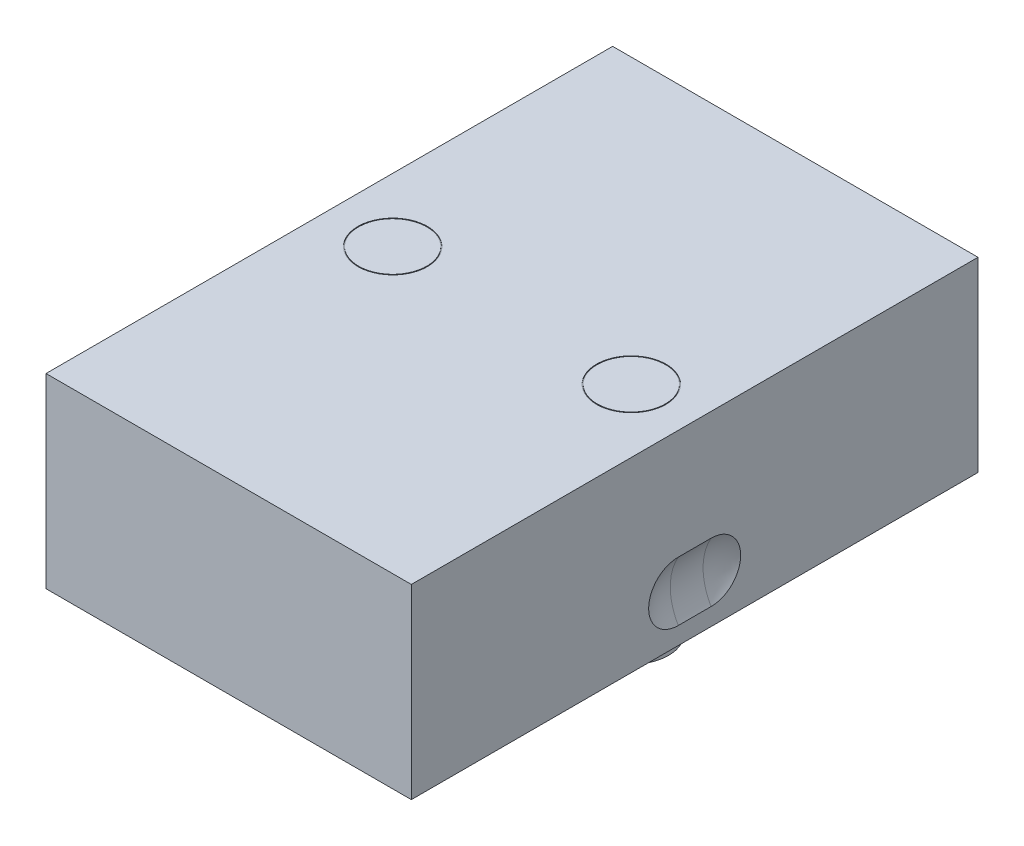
ISO-10303-21;
HEADER;
FILE_DESCRIPTION(('STEP AP214'),'2;1');
FILE_NAME('part.step','',(''),(''),'','','');
FILE_SCHEMA(('AUTOMOTIVE_DESIGN { 1 0 10303 214 1 1 1 1 }'));
ENDSEC;
DATA;
#1=APPLICATION_CONTEXT('core data for automotive mechanical design processes');
#2=APPLICATION_PROTOCOL_DEFINITION('international standard','automotive_design',2000,#1);
#3=PRODUCT_CONTEXT('',#1,'mechanical');
#4=PRODUCT('Part','Part','',(#3));
#5=PRODUCT_RELATED_PRODUCT_CATEGORY('part','',(#4));
#6=PRODUCT_DEFINITION_FORMATION('','',#4);
#7=PRODUCT_DEFINITION_CONTEXT('part definition',#1,'design');
#8=PRODUCT_DEFINITION('design','',#6,#7);
#9=PRODUCT_DEFINITION_SHAPE('','',#8);
#10=(LENGTH_UNIT() NAMED_UNIT(*) SI_UNIT(.MILLI.,.METRE.));
#11=(NAMED_UNIT(*) PLANE_ANGLE_UNIT() SI_UNIT($,.RADIAN.));
#12=(NAMED_UNIT(*) SI_UNIT($,.STERADIAN.) SOLID_ANGLE_UNIT());
#13=UNCERTAINTY_MEASURE_WITH_UNIT(LENGTH_MEASURE(1.E-05),#10,'distance_accuracy_value','');
#14=(GEOMETRIC_REPRESENTATION_CONTEXT(3) GLOBAL_UNCERTAINTY_ASSIGNED_CONTEXT((#13)) GLOBAL_UNIT_ASSIGNED_CONTEXT((#10,
#11,#12)) REPRESENTATION_CONTEXT('',''));
#15=CARTESIAN_POINT('',(0.,0.,0.));
#16=DIRECTION('',(0.,0.,1.));
#17=DIRECTION('',(1.,0.,0.));
#18=AXIS2_PLACEMENT_3D('',#15,#16,#17);
#19=CARTESIAN_POINT('',(-16.,72.,0.));
#20=DIRECTION('',(0.,1.,0.));
#21=DIRECTION('',(0.,0.,1.));
#22=AXIS2_PLACEMENT_3D('',#19,#20,#21);
#23=PLANE('',#22);
#24=CARTESIAN_POINT('',(-16.,72.,0.));
#25=DIRECTION('',(0.,-1.,0.));
#26=DIRECTION('',(0.,0.,-1.));
#27=AXIS2_PLACEMENT_3D('',#24,#25,#26);
#28=CIRCLE('',#27,4.57);
#29=CARTESIAN_POINT('',(-16.,72.,-4.57));
#30=VERTEX_POINT('',#29);
#31=EDGE_CURVE('E9',#30,#30,#28,.F.);
#32=ORIENTED_EDGE('',*,*,#31,.F.);
#33=EDGE_LOOP('',(#32));
#34=FACE_BOUND('',#33,.T.);
#35=ADVANCED_FACE('F14',(#34),#23,.F.);
#36=CARTESIAN_POINT('',(-16.,75.,0.));
#37=DIRECTION('',(0.,1.,0.));
#38=DIRECTION('',(0.,0.,1.));
#39=AXIS2_PLACEMENT_3D('',#36,#37,#38);
#40=PLANE('',#39);
#41=CARTESIAN_POINT('',(-16.,75.,0.));
#42=DIRECTION('',(0.,1.,0.));
#43=DIRECTION('',(0.,0.,1.));
#44=AXIS2_PLACEMENT_3D('',#41,#42,#43);
#45=CIRCLE('',#44,4.67);
#46=CARTESIAN_POINT('',(-16.,75.,4.67));
#47=VERTEX_POINT('',#46);
#48=EDGE_CURVE('E255',#47,#47,#45,.T.);
#49=ORIENTED_EDGE('',*,*,#48,.F.);
#50=EDGE_LOOP('',(#49));
#51=FACE_BOUND('',#50,.T.);
#52=CARTESIAN_POINT('',(16.,75.,0.));
#53=DIRECTION('',(0.,1.,0.));
#54=DIRECTION('',(0.,0.,1.));
#55=AXIS2_PLACEMENT_3D('',#52,#53,#54);
#56=CIRCLE('',#55,4.67);
#57=CARTESIAN_POINT('',(16.,75.,4.67));
#58=VERTEX_POINT('',#57);
#59=EDGE_CURVE('E238',#58,#58,#56,.T.);
#60=ORIENTED_EDGE('',*,*,#59,.F.);
#61=EDGE_LOOP('',(#60));
#62=FACE_BOUND('',#61,.T.);
#63=DIRECTION('',(0.,0.,1.));
#64=VECTOR('',#63,1.);
#65=CARTESIAN_POINT('',(-24.5,75.,0.));
#66=LINE('',#65,#64);
#67=CARTESIAN_POINT('',(-24.5,75.,-38.));
#68=VERTEX_POINT('',#67);
#69=CARTESIAN_POINT('',(-24.5,75.,38.));
#70=VERTEX_POINT('',#69);
#71=EDGE_CURVE('E222',#68,#70,#66,.T.);
#72=ORIENTED_EDGE('',*,*,#71,.T.);
#73=DIRECTION('',(1.,0.,0.));
#74=VECTOR('',#73,1.);
#75=CARTESIAN_POINT('',(0.,75.,38.));
#76=LINE('',#75,#74);
#77=CARTESIAN_POINT('',(24.5,75.,38.));
#78=VERTEX_POINT('',#77);
#79=EDGE_CURVE('E220',#70,#78,#76,.T.);
#80=ORIENTED_EDGE('',*,*,#79,.T.);
#81=DIRECTION('',(0.,0.,1.));
#82=VECTOR('',#81,1.);
#83=CARTESIAN_POINT('',(24.5,75.,0.));
#84=LINE('',#83,#82);
#85=CARTESIAN_POINT('',(24.5,75.,-38.));
#86=VERTEX_POINT('',#85);
#87=EDGE_CURVE('E214',#78,#86,#84,.F.);
#88=ORIENTED_EDGE('',*,*,#87,.T.);
#89=DIRECTION('',(1.,0.,0.));
#90=VECTOR('',#89,1.);
#91=CARTESIAN_POINT('',(0.,75.,-38.));
#92=LINE('',#91,#90);
#93=EDGE_CURVE('E225',#86,#68,#92,.F.);
#94=ORIENTED_EDGE('',*,*,#93,.T.);
#95=EDGE_LOOP('',(#72,#80,#88,#94));
#96=FACE_BOUND('',#95,.T.);
#97=ADVANCED_FACE('F182',(#51,#62,#96),#40,.T.);
#98=CARTESIAN_POINT('',(16.,72.,0.));
#99=DIRECTION('',(0.,1.,0.));
#100=DIRECTION('',(0.,0.,1.));
#101=AXIS2_PLACEMENT_3D('',#98,#99,#100);
#102=PLANE('',#101);
#103=CARTESIAN_POINT('',(16.,72.,0.));
#104=DIRECTION('',(0.,-1.,0.));
#105=DIRECTION('',(0.,0.,-1.));
#106=AXIS2_PLACEMENT_3D('',#103,#104,#105);
#107=CIRCLE('',#106,4.57);
#108=CARTESIAN_POINT('',(16.,72.,-4.57));
#109=VERTEX_POINT('',#108);
#110=EDGE_CURVE('E23',#109,#109,#107,.F.);
#111=ORIENTED_EDGE('',*,*,#110,.F.);
#112=EDGE_LOOP('',(#111));
#113=FACE_BOUND('',#112,.T.);
#114=ADVANCED_FACE('F179',(#113),#102,.F.);
#115=CARTESIAN_POINT('',(16.,62.5,0.));
#116=DIRECTION('',(0.,-1.,0.));
#117=DIRECTION('',(0.,0.,-1.));
#118=AXIS2_PLACEMENT_3D('',#115,#116,#117);
#119=CYLINDRICAL_SURFACE('',#118,4.57);
#120=CARTESIAN_POINT('',(16.,53.,0.));
#121=DIRECTION('',(0.,-1.,0.));
#122=DIRECTION('',(0.,0.,-1.));
#123=AXIS2_PLACEMENT_3D('',#120,#121,#122);
#124=CIRCLE('',#123,4.57);
#125=CARTESIAN_POINT('',(16.,53.,-4.57));
#126=VERTEX_POINT('',#125);
#127=EDGE_CURVE('E343',#126,#126,#124,.F.);
#128=ORIENTED_EDGE('',*,*,#127,.F.);
#129=EDGE_LOOP('',(#128));
#130=FACE_BOUND('',#129,.T.);
#131=ORIENTED_EDGE('',*,*,#110,.T.);
#132=EDGE_LOOP('',(#131));
#133=FACE_BOUND('',#132,.T.);
#134=ADVANCED_FACE('F181',(#130,#133),#119,.F.);
#135=CARTESIAN_POINT('',(19.785,53.,0.));
#136=DIRECTION('',(0.,-1.,0.));
#137=DIRECTION('',(0.,0.,-1.));
#138=AXIS2_PLACEMENT_3D('',#135,#136,#137);
#139=PLANE('',#138);
#140=ORIENTED_EDGE('',*,*,#127,.T.);
#141=EDGE_LOOP('',(#140));
#142=FACE_BOUND('',#141,.T.);
#143=CARTESIAN_POINT('',(16.,52.9999999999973,0.));
#144=DIRECTION('',(0.,1.,0.));
#145=DIRECTION('',(0.,0.,1.));
#146=AXIS2_PLACEMENT_3D('',#143,#144,#145);
#147=CIRCLE('',#146,3.00000000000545);
#148=CARTESIAN_POINT('',(16.,52.9999999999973,3.00000000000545));
#149=VERTEX_POINT('',#148);
#150=EDGE_CURVE('E357',#149,#149,#147,.T.);
#151=ORIENTED_EDGE('',*,*,#150,.F.);
#152=EDGE_LOOP('',(#151));
#153=FACE_BOUND('',#152,.T.);
#154=ADVANCED_FACE('F189',(#142,#153),#139,.F.);
#155=CARTESIAN_POINT('',(16.,52.9999999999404,0.));
#156=DIRECTION('',(0.,1.,0.));
#157=DIRECTION('',(0.,0.,1.));
#158=AXIS2_PLACEMENT_3D('',#155,#156,#157);
#159=CONICAL_SURFACE('',#158,2.99999999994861,0.785398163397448);
#160=CARTESIAN_POINT('',(16.,52.6,0.));
#161=DIRECTION('',(0.,-1.,0.));
#162=DIRECTION('',(0.,0.,-1.));
#163=AXIS2_PLACEMENT_3D('',#160,#161,#162);
#164=CIRCLE('',#163,2.6);
#165=CARTESIAN_POINT('',(16.,52.6,-2.6));
#166=VERTEX_POINT('',#165);
#167=EDGE_CURVE('E230',#166,#166,#164,.T.);
#168=ORIENTED_EDGE('',*,*,#167,.T.);
#169=EDGE_LOOP('',(#168));
#170=FACE_BOUND('',#169,.T.);
#171=ORIENTED_EDGE('',*,*,#150,.T.);
#172=EDGE_LOOP('',(#171));
#173=FACE_BOUND('',#172,.T.);
#174=ADVANCED_FACE('F299',(#170,#173),#159,.F.);
#175=CARTESIAN_POINT('',(16.,49.3,0.));
#176=DIRECTION('',(0.,-1.,0.));
#177=DIRECTION('',(0.,0.,-1.));
#178=AXIS2_PLACEMENT_3D('',#175,#176,#177);
#179=CYLINDRICAL_SURFACE('',#178,2.6);
#180=CARTESIAN_POINT('',(16.,46.,0.));
#181=DIRECTION('',(0.,-1.,0.));
#182=DIRECTION('',(0.,0.,-1.));
#183=AXIS2_PLACEMENT_3D('',#180,#181,#182);
#184=CIRCLE('',#183,2.6);
#185=CARTESIAN_POINT('',(16.,46.,-2.6));
#186=VERTEX_POINT('',#185);
#187=EDGE_CURVE('E352',#186,#186,#184,.F.);
#188=ORIENTED_EDGE('',*,*,#187,.F.);
#189=EDGE_LOOP('',(#188));
#190=FACE_BOUND('',#189,.T.);
#191=ORIENTED_EDGE('',*,*,#167,.F.);
#192=EDGE_LOOP('',(#191));
#193=FACE_BOUND('',#192,.T.);
#194=ADVANCED_FACE('F302',(#190,#193),#179,.F.);
#195=CARTESIAN_POINT('',(18.5,46.,0.));
#196=DIRECTION('',(0.,-1.,0.));
#197=DIRECTION('',(0.,0.,-1.));
#198=AXIS2_PLACEMENT_3D('',#195,#196,#197);
#199=PLANE('',#198);
#200=CARTESIAN_POINT('',(16.,46.,0.));
#201=DIRECTION('',(0.,-1.,0.));
#202=DIRECTION('',(0.,0.,-1.));
#203=AXIS2_PLACEMENT_3D('',#200,#201,#202);
#204=CIRCLE('',#203,5.);
#205=CARTESIAN_POINT('',(16.,46.,-5.));
#206=VERTEX_POINT('',#205);
#207=EDGE_CURVE('E79',#206,#206,#204,.F.);
#208=ORIENTED_EDGE('',*,*,#207,.F.);
#209=EDGE_LOOP('',(#208));
#210=FACE_BOUND('',#209,.T.);
#211=ORIENTED_EDGE('',*,*,#187,.T.);
#212=EDGE_LOOP('',(#211));
#213=FACE_BOUND('',#212,.T.);
#214=ADVANCED_FACE('F309',(#210,#213),#199,.T.);
#215=CARTESIAN_POINT('',(-16.,48.5,0.));
#216=DIRECTION('',(0.,-1.,0.));
#217=DIRECTION('',(0.,0.,-1.));
#218=AXIS2_PLACEMENT_3D('',#215,#216,#217);
#219=CYLINDRICAL_SURFACE('',#218,5.);
#220=CARTESIAN_POINT('',(-16.,50.,0.));
#221=DIRECTION('',(0.,-1.,0.));
#222=DIRECTION('',(0.,0.,-1.));
#223=AXIS2_PLACEMENT_3D('',#220,#221,#222);
#224=CIRCLE('',#223,5.);
#225=CARTESIAN_POINT('',(-16.,50.,-5.));
#226=VERTEX_POINT('',#225);
#227=EDGE_CURVE('E602',#226,#226,#224,.T.);
#228=ORIENTED_EDGE('',*,*,#227,.T.);
#229=EDGE_LOOP('',(#228));
#230=FACE_BOUND('',#229,.T.);
#231=CARTESIAN_POINT('',(-16.,46.,0.));
#232=DIRECTION('',(0.,-1.,0.));
#233=DIRECTION('',(0.,0.,-1.));
#234=AXIS2_PLACEMENT_3D('',#231,#232,#233);
#235=CIRCLE('',#234,5.);
#236=CARTESIAN_POINT('',(-16.,46.,-5.));
#237=VERTEX_POINT('',#236);
#238=EDGE_CURVE('E340',#237,#237,#235,.F.);
#239=ORIENTED_EDGE('',*,*,#238,.T.);
#240=EDGE_LOOP('',(#239));
#241=FACE_BOUND('',#240,.T.);
#242=ADVANCED_FACE('F193',(#230,#241),#219,.T.);
#243=CARTESIAN_POINT('',(16.,48.5,0.));
#244=DIRECTION('',(0.,-1.,0.));
#245=DIRECTION('',(0.,0.,-1.));
#246=AXIS2_PLACEMENT_3D('',#243,#244,#245);
#247=CYLINDRICAL_SURFACE('',#246,5.);
#248=CARTESIAN_POINT('',(16.,50.,0.));
#249=DIRECTION('',(0.,-1.,0.));
#250=DIRECTION('',(0.,0.,-1.));
#251=AXIS2_PLACEMENT_3D('',#248,#249,#250);
#252=CIRCLE('',#251,5.);
#253=CARTESIAN_POINT('',(16.,50.,-5.));
#254=VERTEX_POINT('',#253);
#255=EDGE_CURVE('E93',#254,#254,#252,.T.);
#256=ORIENTED_EDGE('',*,*,#255,.T.);
#257=EDGE_LOOP('',(#256));
#258=FACE_BOUND('',#257,.T.);
#259=ORIENTED_EDGE('',*,*,#207,.T.);
#260=EDGE_LOOP('',(#259));
#261=FACE_BOUND('',#260,.T.);
#262=ADVANCED_FACE('F327',(#258,#261),#247,.T.);
#263=CARTESIAN_POINT('',(31.3299999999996,56.3,2.20000000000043));
#264=DIRECTION('',(0.710359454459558,0.618323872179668,0.33625144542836));
#265=DIRECTION('',(0.703004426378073,-0.646571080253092,-0.296193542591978));
#266=AXIS2_PLACEMENT_3D('',#263,#264,#265);
#267=SPHERICAL_SURFACE('',#266,7.9);
#268=CARTESIAN_POINT('',(31.33,56.3,2.2));
#269=DIRECTION('',(0.,0.,-1.));
#270=DIRECTION('',(-1.,0.,0.));
#271=AXIS2_PLACEMENT_3D('',#268,#269,#270);
#272=CIRCLE('',#271,7.9);
#273=CARTESIAN_POINT('',(24.5,52.3299748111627,2.2));
#274=VERTEX_POINT('',#273);
#275=CARTESIAN_POINT('',(24.5,60.270025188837,2.2));
#276=VERTEX_POINT('',#275);
#277=EDGE_CURVE('E71',#274,#276,#272,.T.);
#278=ORIENTED_EDGE('',*,*,#277,.T.);
#279=CARTESIAN_POINT('',(24.5,52.3299748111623,2.2));
#280=CARTESIAN_POINT('',(24.5,52.3299641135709,2.31166044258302));
#281=CARTESIAN_POINT('',(24.5,52.3346855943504,2.42331581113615));
#282=CARTESIAN_POINT('',(24.5,52.3535101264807,2.64582772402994));
#283=CARTESIAN_POINT('',(24.5,52.3676127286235,2.75668430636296));
#284=CARTESIAN_POINT('',(24.5,52.4051035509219,2.97674344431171));
#285=CARTESIAN_POINT('',(24.5,52.4284852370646,3.08594710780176));
#286=CARTESIAN_POINT('',(24.5,52.4843445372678,3.30196987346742));
#287=CARTESIAN_POINT('',(24.5,52.516822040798,3.4087890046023));
#288=CARTESIAN_POINT('',(24.5,52.627634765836,3.72463545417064));
#289=CARTESIAN_POINT('',(24.5,52.7193661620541,3.92914501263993));
#290=CARTESIAN_POINT('',(24.5,52.9357981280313,4.31970636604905));
#291=CARTESIAN_POINT('',(24.5,53.0604922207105,4.50576177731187));
#292=CARTESIAN_POINT('',(24.5,53.339358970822,4.85433446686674));
#293=CARTESIAN_POINT('',(24.5,53.493532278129,5.01685122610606));
#294=CARTESIAN_POINT('',(24.5,53.8269954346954,5.3137113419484));
#295=CARTESIAN_POINT('',(24.5,54.0062891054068,5.4480504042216));
#296=CARTESIAN_POINT('',(24.5,54.3848790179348,5.68471531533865));
#297=CARTESIAN_POINT('',(24.5,54.5841743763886,5.78704257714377));
#298=CARTESIAN_POINT('',(24.5,54.9971025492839,5.95677870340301));
#299=CARTESIAN_POINT('',(24.5,55.2107344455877,6.02418980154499));
#300=CARTESIAN_POINT('',(24.5,55.6462877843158,6.12219183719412));
#301=CARTESIAN_POINT('',(24.5,55.8682093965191,6.15278202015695));
#302=CARTESIAN_POINT('',(24.5,56.3140435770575,6.1762713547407));
#303=CARTESIAN_POINT('',(24.5,56.5379561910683,6.16916963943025));
#304=CARTESIAN_POINT('',(24.5,56.9814086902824,6.11747528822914));
#305=CARTESIAN_POINT('',(24.5,57.2009486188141,6.07288302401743));
#306=CARTESIAN_POINT('',(24.5,57.6294255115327,5.94747334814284));
#307=CARTESIAN_POINT('',(24.5,57.8383625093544,5.86665605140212));
#308=CARTESIAN_POINT('',(24.5,58.23970747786,5.67109073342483));
#309=CARTESIAN_POINT('',(24.5,58.432115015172,5.5563418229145));
#310=CARTESIAN_POINT('',(24.5,58.7949275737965,5.29616752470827));
#311=CARTESIAN_POINT('',(24.5,58.9653336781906,5.15074364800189));
#312=CARTESIAN_POINT('',(24.5,59.2792822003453,4.83340459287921));
#313=CARTESIAN_POINT('',(24.5,59.4228282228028,4.66149297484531));
#314=CARTESIAN_POINT('',(24.5,59.6791046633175,4.29583833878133));
#315=CARTESIAN_POINT('',(24.5,59.7918252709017,4.1020883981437));
#316=CARTESIAN_POINT('',(24.5,59.9352824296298,3.79948806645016));
#317=CARTESIAN_POINT('',(24.5,59.9788567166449,3.69653366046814));
#318=CARTESIAN_POINT('',(24.5,60.0571708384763,3.48732952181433));
#319=CARTESIAN_POINT('',(24.5,60.0919139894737,3.38108104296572));
#320=CARTESIAN_POINT('',(24.5,60.1522829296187,3.1661621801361));
#321=CARTESIAN_POINT('',(24.5,60.1779187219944,3.05749459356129));
#322=CARTESIAN_POINT('',(24.5,60.2199409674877,2.83842795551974));
#323=CARTESIAN_POINT('',(24.5,60.2363319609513,2.72802978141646));
#324=CARTESIAN_POINT('',(24.5,60.2553736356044,2.54782627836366));
#325=CARTESIAN_POINT('',(24.5,60.2608714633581,2.47830923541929));
#326=CARTESIAN_POINT('',(24.5,60.2681945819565,2.3391972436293));
#327=CARTESIAN_POINT('',(24.5,60.270025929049,2.26960261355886));
#328=CARTESIAN_POINT('',(24.5,60.2700251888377,2.2));
#329=B_SPLINE_CURVE_WITH_KNOTS('',3,(#279,#280,#281,#282,#283,#284,#285,#286,#287,#288,#289,
#290,#291,#292,#293,#294,#295,#296,#297,#298,#299,#300,#301,#302,#303,#304,#305,#306,#307,#308,
#309,#310,#311,#312,#313,#314,#315,#316,#317,#318,#319,#320,#321,#322,#323,#324,#325,#326,#327,
#328),.UNSPECIFIED.,.F.,.F.,(4,2,2,2,2,2,2,2,2,2,2,2,2,2,2,2,2,2,2,2,2,2,2,2,4),(0.,
0.334872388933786,0.669728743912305,1.00434972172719,1.33896663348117,2.00792040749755,
2.67674283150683,3.34558000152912,4.01451902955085,4.68342852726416,5.35229522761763,
6.0211756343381,6.69007142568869,7.35896058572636,8.02784762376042,8.69675219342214,
9.36562382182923,10.0344056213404,10.7034000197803,11.0384618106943,11.373397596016,
11.7079643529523,12.0423666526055,12.2514802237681,12.4602480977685),.UNSPECIFIED.);
#330=EDGE_CURVE('E76',#274,#276,#329,.T.);
#331=ORIENTED_EDGE('',*,*,#330,.F.);
#332=EDGE_LOOP('',(#278,#331));
#333=FACE_BOUND('',#332,.T.);
#334=ADVANCED_FACE('F74',(#333),#267,.F.);
#335=CARTESIAN_POINT('',(31.3299999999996,56.3,-2.20000000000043));
#336=DIRECTION('',(0.710359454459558,0.618323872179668,0.33625144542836));
#337=DIRECTION('',(0.703004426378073,-0.646571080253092,-0.296193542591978));
#338=AXIS2_PLACEMENT_3D('',#335,#336,#337);
#339=SPHERICAL_SURFACE('',#338,7.9);
#340=CARTESIAN_POINT('',(31.33,56.3,-2.2));
#341=DIRECTION('',(0.,0.,-1.));
#342=DIRECTION('',(-1.,0.,0.));
#343=AXIS2_PLACEMENT_3D('',#340,#341,#342);
#344=CIRCLE('',#343,7.9);
#345=CARTESIAN_POINT('',(24.5,52.329974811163,-2.2));
#346=VERTEX_POINT('',#345);
#347=CARTESIAN_POINT('',(24.5,60.2700251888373,-2.2));
#348=VERTEX_POINT('',#347);
#349=EDGE_CURVE('E78',#346,#348,#344,.T.);
#350=ORIENTED_EDGE('',*,*,#349,.F.);
#351=CARTESIAN_POINT('',(24.5,60.2700251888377,-2.2));
#352=CARTESIAN_POINT('',(24.5,60.2700358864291,-2.31166044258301));
#353=CARTESIAN_POINT('',(24.5,60.2653144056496,-2.42331581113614));
#354=CARTESIAN_POINT('',(24.5,60.2464898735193,-2.64582772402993));
#355=CARTESIAN_POINT('',(24.5,60.2323872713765,-2.75668430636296));
#356=CARTESIAN_POINT('',(24.5,60.1948964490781,-2.9767434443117));
#357=CARTESIAN_POINT('',(24.5,60.1715147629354,-3.08594710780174));
#358=CARTESIAN_POINT('',(24.5,60.1156554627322,-3.30196987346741));
#359=CARTESIAN_POINT('',(24.5,60.083177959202,-3.4087890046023));
#360=CARTESIAN_POINT('',(24.5,59.9723652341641,-3.72463545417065));
#361=CARTESIAN_POINT('',(24.5,59.8806338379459,-3.92914501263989));
#362=CARTESIAN_POINT('',(24.5,59.6642018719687,-4.31970636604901));
#363=CARTESIAN_POINT('',(24.5,59.5395077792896,-4.50576177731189));
#364=CARTESIAN_POINT('',(24.5,59.2606410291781,-4.85433446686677));
#365=CARTESIAN_POINT('',(24.5,59.106467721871,-5.01685122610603));
#366=CARTESIAN_POINT('',(24.5,58.7730045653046,-5.31371134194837));
#367=CARTESIAN_POINT('',(24.5,58.5937108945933,-5.44805040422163));
#368=CARTESIAN_POINT('',(24.5,58.2151209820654,-5.6847153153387));
#369=CARTESIAN_POINT('',(24.5,58.0158256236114,-5.78704257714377));
#370=CARTESIAN_POINT('',(24.5,57.6028974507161,-5.95677870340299));
#371=CARTESIAN_POINT('',(24.5,57.3892655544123,-6.024189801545));
#372=CARTESIAN_POINT('',(24.5,56.9537122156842,-6.12219183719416));
#373=CARTESIAN_POINT('',(24.5,56.7317906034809,-6.152782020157));
#374=CARTESIAN_POINT('',(24.5,56.2859564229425,-6.17627135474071));
#375=CARTESIAN_POINT('',(24.5,56.0620438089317,-6.16916963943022));
#376=CARTESIAN_POINT('',(24.5,55.6185913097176,-6.1174752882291));
#377=CARTESIAN_POINT('',(24.5,55.3990513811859,-6.07288302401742));
#378=CARTESIAN_POINT('',(24.5,54.9705744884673,-5.94747334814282));
#379=CARTESIAN_POINT('',(24.5,54.7616374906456,-5.86665605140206));
#380=CARTESIAN_POINT('',(24.5,54.36029252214,-5.67109073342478));
#381=CARTESIAN_POINT('',(24.5,54.1678849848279,-5.5563418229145));
#382=CARTESIAN_POINT('',(24.5,53.8050724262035,-5.29616752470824));
#383=CARTESIAN_POINT('',(24.5,53.6346663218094,-5.15074364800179));
#384=CARTESIAN_POINT('',(24.5,53.3207177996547,-4.8334045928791));
#385=CARTESIAN_POINT('',(24.5,53.1771717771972,-4.66149297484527));
#386=CARTESIAN_POINT('',(24.5,52.9208953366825,-4.29583833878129));
#387=CARTESIAN_POINT('',(24.5,52.8081747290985,-4.10208839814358));
#388=CARTESIAN_POINT('',(24.5,52.6647175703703,-3.79948806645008));
#389=CARTESIAN_POINT('',(24.5,52.6211432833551,-3.69653366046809));
#390=CARTESIAN_POINT('',(24.5,52.5428291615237,-3.4873295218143));
#391=CARTESIAN_POINT('',(24.5,52.5080860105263,-3.38108104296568));
#392=CARTESIAN_POINT('',(24.5,52.4477170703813,-3.16616218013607));
#393=CARTESIAN_POINT('',(24.5,52.4220812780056,-3.05749459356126));
#394=CARTESIAN_POINT('',(24.5,52.3800590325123,-2.8384279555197));
#395=CARTESIAN_POINT('',(24.5,52.3636680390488,-2.7280297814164));
#396=CARTESIAN_POINT('',(24.5,52.3446263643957,-2.54782627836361));
#397=CARTESIAN_POINT('',(24.5,52.3391285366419,-2.47830923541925));
#398=CARTESIAN_POINT('',(24.5,52.3318054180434,-2.33919724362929));
#399=CARTESIAN_POINT('',(24.5,52.3299740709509,-2.26960261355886));
#400=CARTESIAN_POINT('',(24.5,52.3299748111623,-2.2));
#401=B_SPLINE_CURVE_WITH_KNOTS('',3,(#351,#352,#353,#354,#355,#356,#357,#358,#359,#360,#361,
#362,#363,#364,#365,#366,#367,#368,#369,#370,#371,#372,#373,#374,#375,#376,#377,#378,#379,#380,
#381,#382,#383,#384,#385,#386,#387,#388,#389,#390,#391,#392,#393,#394,#395,#396,#397,#398,#399,
#400),.UNSPECIFIED.,.F.,.F.,(4,2,2,2,2,2,2,2,2,2,2,2,2,2,2,2,2,2,2,2,2,2,2,2,4),(0.,
0.334872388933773,0.669728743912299,1.00434972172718,1.33896663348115,2.00792040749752,
2.6767428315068,3.3455800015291,4.01451902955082,4.68342852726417,5.35229522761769,
6.02117563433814,6.69007142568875,7.35896058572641,8.02784762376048,8.69675219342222,
9.36562382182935,10.0344056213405,10.7034000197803,11.0384618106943,11.373397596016,
11.7079643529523,12.0423666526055,12.2514802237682,12.4602480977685),.UNSPECIFIED.);
#402=EDGE_CURVE('E88',#348,#346,#401,.T.);
#403=ORIENTED_EDGE('',*,*,#402,.F.);
#404=EDGE_LOOP('',(#350,#403));
#405=FACE_BOUND('',#404,.T.);
#406=ADVANCED_FACE('F157',(#405),#339,.F.);
#407=CARTESIAN_POINT('',(31.33,56.3,0.));
#408=DIRECTION('',(0.,0.,-1.));
#409=DIRECTION('',(-1.,0.,0.));
#410=AXIS2_PLACEMENT_3D('',#407,#408,#409);
#411=CYLINDRICAL_SURFACE('',#410,7.9);
#412=ORIENTED_EDGE('',*,*,#277,.F.);
#413=DIRECTION('',(0.,0.,-1.));
#414=VECTOR('',#413,1.);
#415=CARTESIAN_POINT('',(24.5,52.329974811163,-38.));
#416=LINE('',#415,#414);
#417=EDGE_CURVE('E91',#346,#274,#416,.F.);
#418=ORIENTED_EDGE('',*,*,#417,.F.);
#419=ORIENTED_EDGE('',*,*,#349,.T.);
#420=DIRECTION('',(0.,0.,-1.));
#421=VECTOR('',#420,1.);
#422=CARTESIAN_POINT('',(24.5,60.270025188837,-38.));
#423=LINE('',#422,#421);
#424=EDGE_CURVE('E82',#276,#348,#423,.T.);
#425=ORIENTED_EDGE('',*,*,#424,.F.);
#426=EDGE_LOOP('',(#412,#418,#419,#425));
#427=FACE_BOUND('',#426,.T.);
#428=ADVANCED_FACE('F83',(#427),#411,.F.);
#429=CARTESIAN_POINT('',(-31.3299999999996,56.3,-2.20000000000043));
#430=DIRECTION('',(0.710359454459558,0.618323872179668,0.33625144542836));
#431=DIRECTION('',(0.703004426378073,-0.646571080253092,-0.296193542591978));
#432=AXIS2_PLACEMENT_3D('',#429,#430,#431);
#433=SPHERICAL_SURFACE('',#432,7.9);
#434=CARTESIAN_POINT('',(-31.33,56.3,-2.2));
#435=DIRECTION('',(0.,0.,1.));
#436=DIRECTION('',(1.,0.,0.));
#437=AXIS2_PLACEMENT_3D('',#434,#435,#436);
#438=CIRCLE('',#437,7.9);
#439=CARTESIAN_POINT('',(-24.5,52.3299748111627,-2.2));
#440=VERTEX_POINT('',#439);
#441=CARTESIAN_POINT('',(-24.5,60.270025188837,-2.2));
#442=VERTEX_POINT('',#441);
#443=EDGE_CURVE('E578',#440,#442,#438,.T.);
#444=ORIENTED_EDGE('',*,*,#443,.T.);
#445=CARTESIAN_POINT('',(-24.5,52.3299748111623,-2.2));
#446=CARTESIAN_POINT('',(-24.5,52.3299641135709,-2.31166044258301));
#447=CARTESIAN_POINT('',(-24.5,52.3346855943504,-2.42331581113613));
#448=CARTESIAN_POINT('',(-24.5,52.3535101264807,-2.64582772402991));
#449=CARTESIAN_POINT('',(-24.5,52.3676127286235,-2.75668430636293));
#450=CARTESIAN_POINT('',(-24.5,52.4051035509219,-2.97674344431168));
#451=CARTESIAN_POINT('',(-24.5,52.4284852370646,-3.08594710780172));
#452=CARTESIAN_POINT('',(-24.5,52.4843445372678,-3.30196987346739));
#453=CARTESIAN_POINT('',(-24.5,52.516822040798,-3.40878900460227));
#454=CARTESIAN_POINT('',(-24.5,52.6276347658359,-3.72463545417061));
#455=CARTESIAN_POINT('',(-24.5,52.7193661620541,-3.92914501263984));
#456=CARTESIAN_POINT('',(-24.5,52.9357981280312,-4.31970636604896));
#457=CARTESIAN_POINT('',(-24.5,53.0604922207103,-4.50576177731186));
#458=CARTESIAN_POINT('',(-24.5,53.3393589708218,-4.85433446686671));
#459=CARTESIAN_POINT('',(-24.5,53.4935322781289,-5.01685122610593));
#460=CARTESIAN_POINT('',(-24.5,53.8269954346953,-5.3137113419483));
#461=CARTESIAN_POINT('',(-24.5,54.0062891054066,-5.44805040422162));
#462=CARTESIAN_POINT('',(-24.5,54.3848790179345,-5.6847153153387));
#463=CARTESIAN_POINT('',(-24.5,54.5841743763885,-5.78704257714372));
#464=CARTESIAN_POINT('',(-24.5,54.9971025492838,-5.95677870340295));
#465=CARTESIAN_POINT('',(-24.5,55.2107344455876,-6.02418980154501));
#466=CARTESIAN_POINT('',(-24.5,55.6462877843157,-6.12219183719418));
#467=CARTESIAN_POINT('',(-24.5,55.868209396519,-6.15278202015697));
#468=CARTESIAN_POINT('',(-24.5,56.3140435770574,-6.1762713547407));
#469=CARTESIAN_POINT('',(-24.5,56.5379561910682,-6.16916963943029));
#470=CARTESIAN_POINT('',(-24.5,56.9814086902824,-6.11747528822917));
#471=CARTESIAN_POINT('',(-24.5,57.2009486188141,-6.07288302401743));
#472=CARTESIAN_POINT('',(-24.5,57.6294255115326,-5.94747334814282));
#473=CARTESIAN_POINT('',(-24.5,57.8383625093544,-5.86665605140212));
#474=CARTESIAN_POINT('',(-24.5,58.23970747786,-5.67109073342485));
#475=CARTESIAN_POINT('',(-24.5,58.4321150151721,-5.55634182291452));
#476=CARTESIAN_POINT('',(-24.5,58.7949275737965,-5.29616752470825));
#477=CARTESIAN_POINT('',(-24.5,58.9653336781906,-5.15074364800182));
#478=CARTESIAN_POINT('',(-24.5,59.2792822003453,-4.83340459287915));
#479=CARTESIAN_POINT('',(-24.5,59.4228282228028,-4.66149297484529));
#480=CARTESIAN_POINT('',(-24.5,59.6791046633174,-4.29583833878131));
#481=CARTESIAN_POINT('',(-24.5,59.7918252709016,-4.10208839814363));
#482=CARTESIAN_POINT('',(-24.5,59.9352824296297,-3.79948806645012));
#483=CARTESIAN_POINT('',(-24.5,59.9788567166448,-3.69653366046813));
#484=CARTESIAN_POINT('',(-24.5,60.0571708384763,-3.48732952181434));
#485=CARTESIAN_POINT('',(-24.5,60.0919139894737,-3.38108104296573));
#486=CARTESIAN_POINT('',(-24.5,60.1522829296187,-3.16616218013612));
#487=CARTESIAN_POINT('',(-24.5,60.1779187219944,-3.05749459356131));
#488=CARTESIAN_POINT('',(-24.5,60.2199409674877,-2.83842795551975));
#489=CARTESIAN_POINT('',(-24.5,60.2363319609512,-2.72802978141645));
#490=CARTESIAN_POINT('',(-24.5,60.2553736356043,-2.54782627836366));
#491=CARTESIAN_POINT('',(-24.5,60.2608714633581,-2.47830923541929));
#492=CARTESIAN_POINT('',(-24.5,60.2681945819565,-2.3391972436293));
#493=CARTESIAN_POINT('',(-24.5,60.2700259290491,-2.26960261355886));
#494=CARTESIAN_POINT('',(-24.5,60.2700251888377,-2.2));
#495=B_SPLINE_CURVE_WITH_KNOTS('',3,(#445,#446,#447,#448,#449,#450,#451,#452,#453,#454,#455,
#456,#457,#458,#459,#460,#461,#462,#463,#464,#465,#466,#467,#468,#469,#470,#471,#472,#473,#474,
#475,#476,#477,#478,#479,#480,#481,#482,#483,#484,#485,#486,#487,#488,#489,#490,#491,#492,#493,
#494),.UNSPECIFIED.,.F.,.F.,(4,2,2,2,2,2,2,2,2,2,2,2,2,2,2,2,2,2,2,2,2,2,2,2,4),(0.,
0.334872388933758,0.669728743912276,1.00434972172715,1.33896663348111,2.00792040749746,
2.6767428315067,3.34558000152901,4.01451902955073,4.68342852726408,5.3522952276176,
6.02117563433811,6.69007142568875,7.35896058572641,8.02784762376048,8.69675219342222,
9.36562382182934,10.0344056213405,10.7034000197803,11.0384618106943,11.373397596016,
11.7079643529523,12.0423666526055,12.2514802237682,12.4602480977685),.UNSPECIFIED.);
#496=EDGE_CURVE('E141',#440,#442,#495,.T.);
#497=ORIENTED_EDGE('',*,*,#496,.F.);
#498=EDGE_LOOP('',(#444,#497));
#499=FACE_BOUND('',#498,.T.);
#500=ADVANCED_FACE('F150',(#499),#433,.F.);
#501=CARTESIAN_POINT('',(-31.3299999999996,56.3,2.20000000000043));
#502=DIRECTION('',(0.710359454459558,0.618323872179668,0.33625144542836));
#503=DIRECTION('',(0.703004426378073,-0.646571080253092,-0.296193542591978));
#504=AXIS2_PLACEMENT_3D('',#501,#502,#503);
#505=SPHERICAL_SURFACE('',#504,7.9);
#506=CARTESIAN_POINT('',(-31.33,56.3,2.2));
#507=DIRECTION('',(0.,0.,1.));
#508=DIRECTION('',(1.,0.,0.));
#509=AXIS2_PLACEMENT_3D('',#506,#507,#508);
#510=CIRCLE('',#509,7.9);
#511=CARTESIAN_POINT('',(-24.5,52.329974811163,2.2));
#512=VERTEX_POINT('',#511);
#513=CARTESIAN_POINT('',(-24.5,60.2700251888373,2.2));
#514=VERTEX_POINT('',#513);
#515=EDGE_CURVE('E601',#512,#514,#510,.T.);
#516=ORIENTED_EDGE('',*,*,#515,.F.);
#517=CARTESIAN_POINT('',(-24.5,60.2700251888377,2.2));
#518=CARTESIAN_POINT('',(-24.5,60.2700358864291,2.31166044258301));
#519=CARTESIAN_POINT('',(-24.5,60.2653144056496,2.42331581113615));
#520=CARTESIAN_POINT('',(-24.5,60.2464898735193,2.64582772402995));
#521=CARTESIAN_POINT('',(-24.5,60.2323872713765,2.75668430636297));
#522=CARTESIAN_POINT('',(-24.5,60.1948964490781,2.97674344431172));
#523=CARTESIAN_POINT('',(-24.5,60.1715147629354,3.08594710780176));
#524=CARTESIAN_POINT('',(-24.5,60.1156554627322,3.30196987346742));
#525=CARTESIAN_POINT('',(-24.5,60.0831779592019,3.4087890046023));
#526=CARTESIAN_POINT('',(-24.5,59.972365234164,3.72463545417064));
#527=CARTESIAN_POINT('',(-24.5,59.8806338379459,3.92914501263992));
#528=CARTESIAN_POINT('',(-24.5,59.6642018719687,4.31970636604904));
#529=CARTESIAN_POINT('',(-24.5,59.5395077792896,4.50576177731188));
#530=CARTESIAN_POINT('',(-24.5,59.260641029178,4.85433446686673));
#531=CARTESIAN_POINT('',(-24.5,59.106467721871,5.01685122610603));
#532=CARTESIAN_POINT('',(-24.5,58.7730045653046,5.31371134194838));
#533=CARTESIAN_POINT('',(-24.5,58.5937108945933,5.44805040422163));
#534=CARTESIAN_POINT('',(-24.5,58.2151209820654,5.68471531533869));
#535=CARTESIAN_POINT('',(-24.5,58.0158256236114,5.78704257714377));
#536=CARTESIAN_POINT('',(-24.5,57.6028974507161,5.95677870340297));
#537=CARTESIAN_POINT('',(-24.5,57.3892655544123,6.02418980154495));
#538=CARTESIAN_POINT('',(-24.5,56.9537122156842,6.12219183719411));
#539=CARTESIAN_POINT('',(-24.5,56.7317906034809,6.15278202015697));
#540=CARTESIAN_POINT('',(-24.5,56.2859564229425,6.17627135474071));
#541=CARTESIAN_POINT('',(-24.5,56.0620438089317,6.16916963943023));
#542=CARTESIAN_POINT('',(-24.5,55.6185913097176,6.11747528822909));
#543=CARTESIAN_POINT('',(-24.5,55.3990513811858,6.0728830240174));
#544=CARTESIAN_POINT('',(-24.5,54.9705744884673,5.94747334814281));
#545=CARTESIAN_POINT('',(-24.5,54.7616374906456,5.86665605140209));
#546=CARTESIAN_POINT('',(-24.5,54.36029252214,5.67109073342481));
#547=CARTESIAN_POINT('',(-24.5,54.1678849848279,5.5563418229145));
#548=CARTESIAN_POINT('',(-24.5,53.8050724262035,5.29616752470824));
#549=CARTESIAN_POINT('',(-24.5,53.6346663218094,5.15074364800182));
#550=CARTESIAN_POINT('',(-24.5,53.3207177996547,4.83340459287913));
#551=CARTESIAN_POINT('',(-24.5,53.1771717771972,4.66149297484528));
#552=CARTESIAN_POINT('',(-24.5,52.9208953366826,4.2958383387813));
#553=CARTESIAN_POINT('',(-24.5,52.8081747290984,4.10208839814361));
#554=CARTESIAN_POINT('',(-24.5,52.6647175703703,3.7994880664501));
#555=CARTESIAN_POINT('',(-24.5,52.6211432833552,3.6965336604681));
#556=CARTESIAN_POINT('',(-24.5,52.5428291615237,3.4873295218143));
#557=CARTESIAN_POINT('',(-24.5,52.5080860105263,3.38108104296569));
#558=CARTESIAN_POINT('',(-24.5,52.4477170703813,3.16616218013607));
#559=CARTESIAN_POINT('',(-24.5,52.4220812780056,3.05749459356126));
#560=CARTESIAN_POINT('',(-24.5,52.3800590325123,2.83842795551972));
#561=CARTESIAN_POINT('',(-24.5,52.3636680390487,2.72802978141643));
#562=CARTESIAN_POINT('',(-24.5,52.3446263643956,2.54782627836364));
#563=CARTESIAN_POINT('',(-24.5,52.3391285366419,2.47830923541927));
#564=CARTESIAN_POINT('',(-24.5,52.3318054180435,2.33919724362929));
#565=CARTESIAN_POINT('',(-24.5,52.329974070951,2.26960261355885));
#566=CARTESIAN_POINT('',(-24.5,52.3299748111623,2.2));
#567=B_SPLINE_CURVE_WITH_KNOTS('',3,(#517,#518,#519,#520,#521,#522,#523,#524,#525,#526,#527,
#528,#529,#530,#531,#532,#533,#534,#535,#536,#537,#538,#539,#540,#541,#542,#543,#544,#545,#546,
#547,#548,#549,#550,#551,#552,#553,#554,#555,#556,#557,#558,#559,#560,#561,#562,#563,#564,#565,
#566),.UNSPECIFIED.,.F.,.F.,(4,2,2,2,2,2,2,2,2,2,2,2,2,2,2,2,2,2,2,2,2,2,2,2,4),(0.,
0.334872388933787,0.669728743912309,1.00434972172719,1.33896663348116,2.00792040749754,
2.67674283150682,3.3455800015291,4.01451902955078,4.68342852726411,5.35229522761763,
6.02117563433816,6.6900714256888,7.3589605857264,8.02784762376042,8.69675219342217,
9.36562382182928,10.0344056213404,10.7034000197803,11.0384618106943,11.373397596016,
11.7079643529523,12.0423666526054,12.2514802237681,12.4602480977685),.UNSPECIFIED.);
#568=EDGE_CURVE('E135',#514,#512,#567,.T.);
#569=ORIENTED_EDGE('',*,*,#568,.F.);
#570=EDGE_LOOP('',(#516,#569));
#571=FACE_BOUND('',#570,.T.);
#572=ADVANCED_FACE('F155',(#571),#505,.F.);
#573=CARTESIAN_POINT('',(-31.33,56.3,0.));
#574=DIRECTION('',(0.,0.,1.));
#575=DIRECTION('',(1.,0.,0.));
#576=AXIS2_PLACEMENT_3D('',#573,#574,#575);
#577=CYLINDRICAL_SURFACE('',#576,7.9);
#578=ORIENTED_EDGE('',*,*,#443,.F.);
#579=DIRECTION('',(0.,0.,1.));
#580=VECTOR('',#579,1.);
#581=CARTESIAN_POINT('',(-24.5,52.329974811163,38.));
#582=LINE('',#581,#580);
#583=EDGE_CURVE('E149',#512,#440,#582,.F.);
#584=ORIENTED_EDGE('',*,*,#583,.F.);
#585=ORIENTED_EDGE('',*,*,#515,.T.);
#586=DIRECTION('',(0.,0.,1.));
#587=VECTOR('',#586,1.);
#588=CARTESIAN_POINT('',(-24.5,60.270025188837,38.));
#589=LINE('',#588,#587);
#590=EDGE_CURVE('E148',#442,#514,#589,.T.);
#591=ORIENTED_EDGE('',*,*,#590,.F.);
#592=EDGE_LOOP('',(#578,#584,#585,#591));
#593=FACE_BOUND('',#592,.T.);
#594=ADVANCED_FACE('F158',(#593),#577,.F.);
#595=CARTESIAN_POINT('',(0.,50.,0.));
#596=DIRECTION('',(0.,1.,0.));
#597=DIRECTION('',(0.,0.,1.));
#598=AXIS2_PLACEMENT_3D('',#595,#596,#597);
#599=PLANE('',#598);
#600=DIRECTION('',(0.,0.,-1.));
#601=VECTOR('',#600,1.);
#602=CARTESIAN_POINT('',(24.5,50.,-38.));
#603=LINE('',#602,#601);
#604=CARTESIAN_POINT('',(24.5,50.,38.));
#605=VERTEX_POINT('',#604);
#606=CARTESIAN_POINT('',(24.5,50.,-38.));
#607=VERTEX_POINT('',#606);
#608=EDGE_CURVE('E166',#605,#607,#603,.T.);
#609=ORIENTED_EDGE('',*,*,#608,.F.);
#610=DIRECTION('',(1.,0.,0.));
#611=VECTOR('',#610,1.);
#612=CARTESIAN_POINT('',(24.5,50.,38.));
#613=LINE('',#612,#611);
#614=CARTESIAN_POINT('',(-24.5,50.,38.));
#615=VERTEX_POINT('',#614);
#616=EDGE_CURVE('E207',#615,#605,#613,.T.);
#617=ORIENTED_EDGE('',*,*,#616,.F.);
#618=DIRECTION('',(0.,0.,1.));
#619=VECTOR('',#618,1.);
#620=CARTESIAN_POINT('',(-24.5,50.,38.));
#621=LINE('',#620,#619);
#622=CARTESIAN_POINT('',(-24.5,50.,-38.));
#623=VERTEX_POINT('',#622);
#624=EDGE_CURVE('E216',#623,#615,#621,.T.);
#625=ORIENTED_EDGE('',*,*,#624,.F.);
#626=DIRECTION('',(-1.,0.,0.));
#627=VECTOR('',#626,1.);
#628=CARTESIAN_POINT('',(-24.5,50.,-38.));
#629=LINE('',#628,#627);
#630=EDGE_CURVE('E584',#607,#623,#629,.T.);
#631=ORIENTED_EDGE('',*,*,#630,.F.);
#632=EDGE_LOOP('',(#609,#617,#625,#631));
#633=FACE_BOUND('',#632,.T.);
#634=ORIENTED_EDGE('',*,*,#255,.F.);
#635=EDGE_LOOP('',(#634));
#636=FACE_BOUND('',#635,.T.);
#637=ORIENTED_EDGE('',*,*,#227,.F.);
#638=EDGE_LOOP('',(#637));
#639=FACE_BOUND('',#638,.T.);
#640=ADVANCED_FACE('F121',(#633,#636,#639),#599,.F.);
#641=CARTESIAN_POINT('',(-24.5,50.,-38.));
#642=DIRECTION('',(0.,0.,-1.));
#643=DIRECTION('',(-1.,0.,0.));
#644=AXIS2_PLACEMENT_3D('',#641,#642,#643);
#645=PLANE('',#644);
#646=ORIENTED_EDGE('',*,*,#630,.T.);
#647=DIRECTION('',(0.,1.,0.));
#648=VECTOR('',#647,1.);
#649=CARTESIAN_POINT('',(-24.5,50.,-38.));
#650=LINE('',#649,#648);
#651=EDGE_CURVE('E591',#68,#623,#650,.F.);
#652=ORIENTED_EDGE('',*,*,#651,.F.);
#653=ORIENTED_EDGE('',*,*,#93,.F.);
#654=DIRECTION('',(0.,1.,0.));
#655=VECTOR('',#654,1.);
#656=CARTESIAN_POINT('',(24.5,50.,-38.));
#657=LINE('',#656,#655);
#658=EDGE_CURVE('E581',#86,#607,#657,.F.);
#659=ORIENTED_EDGE('',*,*,#658,.T.);
#660=EDGE_LOOP('',(#646,#652,#653,#659));
#661=FACE_BOUND('',#660,.T.);
#662=ADVANCED_FACE('F119',(#661),#645,.T.);
#663=CARTESIAN_POINT('',(24.5,50.,-38.));
#664=DIRECTION('',(1.,0.,0.));
#665=DIRECTION('',(0.,0.,-1.));
#666=AXIS2_PLACEMENT_3D('',#663,#664,#665);
#667=PLANE('',#666);
#668=ORIENTED_EDGE('',*,*,#608,.T.);
#669=ORIENTED_EDGE('',*,*,#658,.F.);
#670=ORIENTED_EDGE('',*,*,#87,.F.);
#671=DIRECTION('',(0.,1.,0.));
#672=VECTOR('',#671,1.);
#673=CARTESIAN_POINT('',(24.5,50.,38.));
#674=LINE('',#673,#672);
#675=EDGE_CURVE('E209',#605,#78,#674,.T.);
#676=ORIENTED_EDGE('',*,*,#675,.F.);
#677=EDGE_LOOP('',(#668,#669,#670,#676));
#678=FACE_BOUND('',#677,.T.);
#679=ORIENTED_EDGE('',*,*,#424,.T.);
#680=ORIENTED_EDGE('',*,*,#402,.T.);
#681=ORIENTED_EDGE('',*,*,#417,.T.);
#682=ORIENTED_EDGE('',*,*,#330,.T.);
#683=EDGE_LOOP('',(#679,#680,#681,#682));
#684=FACE_BOUND('',#683,.T.);
#685=ADVANCED_FACE('F90',(#678,#684),#667,.T.);
#686=CARTESIAN_POINT('',(24.5,50.,38.));
#687=DIRECTION('',(0.,0.,1.));
#688=DIRECTION('',(1.,0.,0.));
#689=AXIS2_PLACEMENT_3D('',#686,#687,#688);
#690=PLANE('',#689);
#691=ORIENTED_EDGE('',*,*,#616,.T.);
#692=ORIENTED_EDGE('',*,*,#675,.T.);
#693=ORIENTED_EDGE('',*,*,#79,.F.);
#694=DIRECTION('',(0.,1.,0.));
#695=VECTOR('',#694,1.);
#696=CARTESIAN_POINT('',(-24.5,50.,38.));
#697=LINE('',#696,#695);
#698=EDGE_CURVE('E32',#70,#615,#697,.F.);
#699=ORIENTED_EDGE('',*,*,#698,.T.);
#700=EDGE_LOOP('',(#691,#692,#693,#699));
#701=FACE_BOUND('',#700,.T.);
#702=ADVANCED_FACE('F118',(#701),#690,.T.);
#703=CARTESIAN_POINT('',(-24.5,50.,38.));
#704=DIRECTION('',(-1.,0.,0.));
#705=DIRECTION('',(0.,0.,1.));
#706=AXIS2_PLACEMENT_3D('',#703,#704,#705);
#707=PLANE('',#706);
#708=ORIENTED_EDGE('',*,*,#624,.T.);
#709=ORIENTED_EDGE('',*,*,#698,.F.);
#710=ORIENTED_EDGE('',*,*,#71,.F.);
#711=ORIENTED_EDGE('',*,*,#651,.T.);
#712=EDGE_LOOP('',(#708,#709,#710,#711));
#713=FACE_BOUND('',#712,.T.);
#714=ORIENTED_EDGE('',*,*,#590,.T.);
#715=ORIENTED_EDGE('',*,*,#568,.T.);
#716=ORIENTED_EDGE('',*,*,#583,.T.);
#717=ORIENTED_EDGE('',*,*,#496,.T.);
#718=EDGE_LOOP('',(#714,#715,#716,#717));
#719=FACE_BOUND('',#718,.T.);
#720=ADVANCED_FACE('F127',(#713,#719),#707,.T.);
#721=CARTESIAN_POINT('',(-13.5,46.,0.));
#722=DIRECTION('',(0.,-1.,0.));
#723=DIRECTION('',(0.,0.,-1.));
#724=AXIS2_PLACEMENT_3D('',#721,#722,#723);
#725=PLANE('',#724);
#726=ORIENTED_EDGE('',*,*,#238,.F.);
#727=EDGE_LOOP('',(#726));
#728=FACE_BOUND('',#727,.T.);
#729=CARTESIAN_POINT('',(-16.,46.,0.));
#730=DIRECTION('',(0.,-1.,0.));
#731=DIRECTION('',(0.,0.,-1.));
#732=AXIS2_PLACEMENT_3D('',#729,#730,#731);
#733=CIRCLE('',#732,2.6);
#734=CARTESIAN_POINT('',(-16.,46.,-2.6));
#735=VERTEX_POINT('',#734);
#736=EDGE_CURVE('E355',#735,#735,#733,.F.);
#737=ORIENTED_EDGE('',*,*,#736,.T.);
#738=EDGE_LOOP('',(#737));
#739=FACE_BOUND('',#738,.T.);
#740=ADVANCED_FACE('F131',(#728,#739),#725,.T.);
#741=CARTESIAN_POINT('',(-16.,49.3,0.));
#742=DIRECTION('',(0.,-1.,0.));
#743=DIRECTION('',(0.,0.,-1.));
#744=AXIS2_PLACEMENT_3D('',#741,#742,#743);
#745=CYLINDRICAL_SURFACE('',#744,2.6);
#746=ORIENTED_EDGE('',*,*,#736,.F.);
#747=EDGE_LOOP('',(#746));
#748=FACE_BOUND('',#747,.T.);
#749=CARTESIAN_POINT('',(-16.,52.6,0.));
#750=DIRECTION('',(0.,-1.,0.));
#751=DIRECTION('',(0.,0.,-1.));
#752=AXIS2_PLACEMENT_3D('',#749,#750,#751);
#753=CIRCLE('',#752,2.6);
#754=CARTESIAN_POINT('',(-16.,52.6,-2.6));
#755=VERTEX_POINT('',#754);
#756=EDGE_CURVE('E232',#755,#755,#753,.T.);
#757=ORIENTED_EDGE('',*,*,#756,.F.);
#758=EDGE_LOOP('',(#757));
#759=FACE_BOUND('',#758,.T.);
#760=ADVANCED_FACE('F298',(#748,#759),#745,.F.);
#761=CARTESIAN_POINT('',(-16.,52.9999999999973,0.));
#762=DIRECTION('',(0.,1.,0.));
#763=DIRECTION('',(0.,0.,1.));
#764=AXIS2_PLACEMENT_3D('',#761,#762,#763);
#765=CONICAL_SURFACE('',#764,3.0000000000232,0.785398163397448);
#766=ORIENTED_EDGE('',*,*,#756,.T.);
#767=EDGE_LOOP('',(#766));
#768=FACE_BOUND('',#767,.T.);
#769=CARTESIAN_POINT('',(-16.,52.9999999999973,0.));
#770=DIRECTION('',(0.,1.,0.));
#771=DIRECTION('',(0.,0.,1.));
#772=AXIS2_PLACEMENT_3D('',#769,#770,#771);
#773=CIRCLE('',#772,3.0000000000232);
#774=CARTESIAN_POINT('',(-16.,52.9999999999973,3.0000000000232));
#775=VERTEX_POINT('',#774);
#776=EDGE_CURVE('E17',#775,#775,#773,.T.);
#777=ORIENTED_EDGE('',*,*,#776,.T.);
#778=EDGE_LOOP('',(#777));
#779=FACE_BOUND('',#778,.T.);
#780=ADVANCED_FACE('F294',(#768,#779),#765,.F.);
#781=CARTESIAN_POINT('',(-12.215,53.,0.));
#782=DIRECTION('',(0.,-1.,0.));
#783=DIRECTION('',(0.,0.,-1.));
#784=AXIS2_PLACEMENT_3D('',#781,#782,#783);
#785=PLANE('',#784);
#786=CARTESIAN_POINT('',(-16.,53.,0.));
#787=DIRECTION('',(0.,-1.,0.));
#788=DIRECTION('',(0.,0.,-1.));
#789=AXIS2_PLACEMENT_3D('',#786,#787,#788);
#790=CIRCLE('',#789,4.57);
#791=CARTESIAN_POINT('',(-16.,53.,-4.57));
#792=VERTEX_POINT('',#791);
#793=EDGE_CURVE('E349',#792,#792,#790,.F.);
#794=ORIENTED_EDGE('',*,*,#793,.T.);
#795=EDGE_LOOP('',(#794));
#796=FACE_BOUND('',#795,.T.);
#797=ORIENTED_EDGE('',*,*,#776,.F.);
#798=EDGE_LOOP('',(#797));
#799=FACE_BOUND('',#798,.T.);
#800=ADVANCED_FACE('F297',(#796,#799),#785,.F.);
#801=CARTESIAN_POINT('',(-16.,62.5,0.));
#802=DIRECTION('',(0.,-1.,0.));
#803=DIRECTION('',(0.,0.,-1.));
#804=AXIS2_PLACEMENT_3D('',#801,#802,#803);
#805=CYLINDRICAL_SURFACE('',#804,4.57);
#806=ORIENTED_EDGE('',*,*,#793,.F.);
#807=EDGE_LOOP('',(#806));
#808=FACE_BOUND('',#807,.T.);
#809=ORIENTED_EDGE('',*,*,#31,.T.);
#810=EDGE_LOOP('',(#809));
#811=FACE_BOUND('',#810,.T.);
#812=ADVANCED_FACE('F192',(#808,#811),#805,.F.);
#813=CARTESIAN_POINT('',(16.,74.9,0.));
#814=DIRECTION('',(0.,1.,0.));
#815=DIRECTION('',(0.,0.,1.));
#816=AXIS2_PLACEMENT_3D('',#813,#814,#815);
#817=CYLINDRICAL_SURFACE('',#816,4.67);
#818=CARTESIAN_POINT('',(16.,74.9,0.));
#819=DIRECTION('',(0.,1.,0.));
#820=DIRECTION('',(0.,0.,1.));
#821=AXIS2_PLACEMENT_3D('',#818,#819,#820);
#822=CIRCLE('',#821,4.67);
#823=CARTESIAN_POINT('',(16.,74.9,4.67));
#824=VERTEX_POINT('',#823);
#825=EDGE_CURVE('E234',#824,#824,#822,.T.);
#826=ORIENTED_EDGE('',*,*,#825,.F.);
#827=EDGE_LOOP('',(#826));
#828=FACE_BOUND('',#827,.T.);
#829=ORIENTED_EDGE('',*,*,#59,.T.);
#830=EDGE_LOOP('',(#829));
#831=FACE_BOUND('',#830,.T.);
#832=ADVANCED_FACE('F197',(#828,#831),#817,.F.);
#833=CARTESIAN_POINT('',(16.,74.9,0.));
#834=DIRECTION('',(0.,1.,0.));
#835=DIRECTION('',(0.,0.,1.));
#836=AXIS2_PLACEMENT_3D('',#833,#834,#835);
#837=PLANE('',#836);
#838=CARTESIAN_POINT('',(16.,74.9,0.));
#839=DIRECTION('',(0.,1.,0.));
#840=DIRECTION('',(0.,0.,1.));
#841=AXIS2_PLACEMENT_3D('',#838,#839,#840);
#842=CIRCLE('',#841,4.57);
#843=CARTESIAN_POINT('',(16.,74.9,4.57));
#844=VERTEX_POINT('',#843);
#845=EDGE_CURVE('E243',#844,#844,#842,.T.);
#846=ORIENTED_EDGE('',*,*,#845,.F.);
#847=EDGE_LOOP('',(#846));
#848=FACE_BOUND('',#847,.T.);
#849=ORIENTED_EDGE('',*,*,#825,.T.);
#850=EDGE_LOOP('',(#849));
#851=FACE_BOUND('',#850,.T.);
#852=ADVANCED_FACE('F286',(#848,#851),#837,.T.);
#853=CARTESIAN_POINT('',(16.,74.9,0.));
#854=DIRECTION('',(0.,1.,0.));
#855=DIRECTION('',(0.,0.,1.));
#856=AXIS2_PLACEMENT_3D('',#853,#854,#855);
#857=CYLINDRICAL_SURFACE('',#856,4.57);
#858=ORIENTED_EDGE('',*,*,#845,.T.);
#859=EDGE_LOOP('',(#858));
#860=FACE_BOUND('',#859,.T.);
#861=CARTESIAN_POINT('',(16.,75.,0.));
#862=DIRECTION('',(0.,1.,0.));
#863=DIRECTION('',(0.,0.,1.));
#864=AXIS2_PLACEMENT_3D('',#861,#862,#863);
#865=CIRCLE('',#864,4.57);
#866=CARTESIAN_POINT('',(16.,75.,4.57));
#867=VERTEX_POINT('',#866);
#868=EDGE_CURVE('E249',#867,#867,#865,.T.);
#869=ORIENTED_EDGE('',*,*,#868,.F.);
#870=EDGE_LOOP('',(#869));
#871=FACE_BOUND('',#870,.T.);
#872=ADVANCED_FACE('F283',(#860,#871),#857,.T.);
#873=ORIENTED_EDGE('',*,*,#868,.T.);
#874=EDGE_LOOP('',(#873));
#875=FACE_BOUND('',#874,.T.);
#876=ADVANCED_FACE('F196',(#875),#40,.T.);
#877=CARTESIAN_POINT('',(-16.,74.9,0.));
#878=DIRECTION('',(0.,1.,0.));
#879=DIRECTION('',(0.,0.,1.));
#880=AXIS2_PLACEMENT_3D('',#877,#878,#879);
#881=CYLINDRICAL_SURFACE('',#880,4.67);
#882=CARTESIAN_POINT('',(-16.,74.9,0.));
#883=DIRECTION('',(0.,1.,0.));
#884=DIRECTION('',(0.,0.,1.));
#885=AXIS2_PLACEMENT_3D('',#882,#883,#884);
#886=CIRCLE('',#885,4.67);
#887=CARTESIAN_POINT('',(-16.,74.9,4.67));
#888=VERTEX_POINT('',#887);
#889=EDGE_CURVE('E252',#888,#888,#886,.T.);
#890=ORIENTED_EDGE('',*,*,#889,.F.);
#891=EDGE_LOOP('',(#890));
#892=FACE_BOUND('',#891,.T.);
#893=ORIENTED_EDGE('',*,*,#48,.T.);
#894=EDGE_LOOP('',(#893));
#895=FACE_BOUND('',#894,.T.);
#896=ADVANCED_FACE('F276',(#892,#895),#881,.F.);
#897=CARTESIAN_POINT('',(-16.,74.9,0.));
#898=DIRECTION('',(0.,1.,0.));
#899=DIRECTION('',(0.,0.,1.));
#900=AXIS2_PLACEMENT_3D('',#897,#898,#899);
#901=PLANE('',#900);
#902=CARTESIAN_POINT('',(-16.,74.9,0.));
#903=DIRECTION('',(0.,1.,0.));
#904=DIRECTION('',(0.,0.,1.));
#905=AXIS2_PLACEMENT_3D('',#902,#903,#904);
#906=CIRCLE('',#905,4.57);
#907=CARTESIAN_POINT('',(-16.,74.9,4.57));
#908=VERTEX_POINT('',#907);
#909=EDGE_CURVE('E258',#908,#908,#906,.T.);
#910=ORIENTED_EDGE('',*,*,#909,.F.);
#911=EDGE_LOOP('',(#910));
#912=FACE_BOUND('',#911,.T.);
#913=ORIENTED_EDGE('',*,*,#889,.T.);
#914=EDGE_LOOP('',(#913));
#915=FACE_BOUND('',#914,.T.);
#916=ADVANCED_FACE('F268',(#912,#915),#901,.T.);
#917=CARTESIAN_POINT('',(-16.,74.9,0.));
#918=DIRECTION('',(0.,1.,0.));
#919=DIRECTION('',(0.,0.,1.));
#920=AXIS2_PLACEMENT_3D('',#917,#918,#919);
#921=CYLINDRICAL_SURFACE('',#920,4.57);
#922=ORIENTED_EDGE('',*,*,#909,.T.);
#923=EDGE_LOOP('',(#922));
#924=FACE_BOUND('',#923,.T.);
#925=CARTESIAN_POINT('',(-16.,75.,0.));
#926=DIRECTION('',(0.,1.,0.));
#927=DIRECTION('',(0.,0.,1.));
#928=AXIS2_PLACEMENT_3D('',#925,#926,#927);
#929=CIRCLE('',#928,4.57);
#930=CARTESIAN_POINT('',(-16.,75.,4.57));
#931=VERTEX_POINT('',#930);
#932=EDGE_CURVE('E261',#931,#931,#929,.T.);
#933=ORIENTED_EDGE('',*,*,#932,.F.);
#934=EDGE_LOOP('',(#933));
#935=FACE_BOUND('',#934,.T.);
#936=ADVANCED_FACE('F266',(#924,#935),#921,.T.);
#937=ORIENTED_EDGE('',*,*,#932,.T.);
#938=EDGE_LOOP('',(#937));
#939=FACE_BOUND('',#938,.T.);
#940=ADVANCED_FACE('F195',(#939),#40,.T.);
#941=CLOSED_SHELL('',(#35,#97,#114,#134,#154,#174,#194,#214,#242,#262,#334,#406,#428,#500,#572,
#594,#640,#662,#685,#702,#720,#740,#760,#780,#800,#812,#832,#852,#872,#876,#896,#916,#936,#940));
#942=MANIFOLD_SOLID_BREP('B1',#941);
#943=ADVANCED_BREP_SHAPE_REPRESENTATION('',(#18,#942),#14);
#944=SHAPE_DEFINITION_REPRESENTATION(#9,#943);
ENDSEC;
END-ISO-10303-21;
